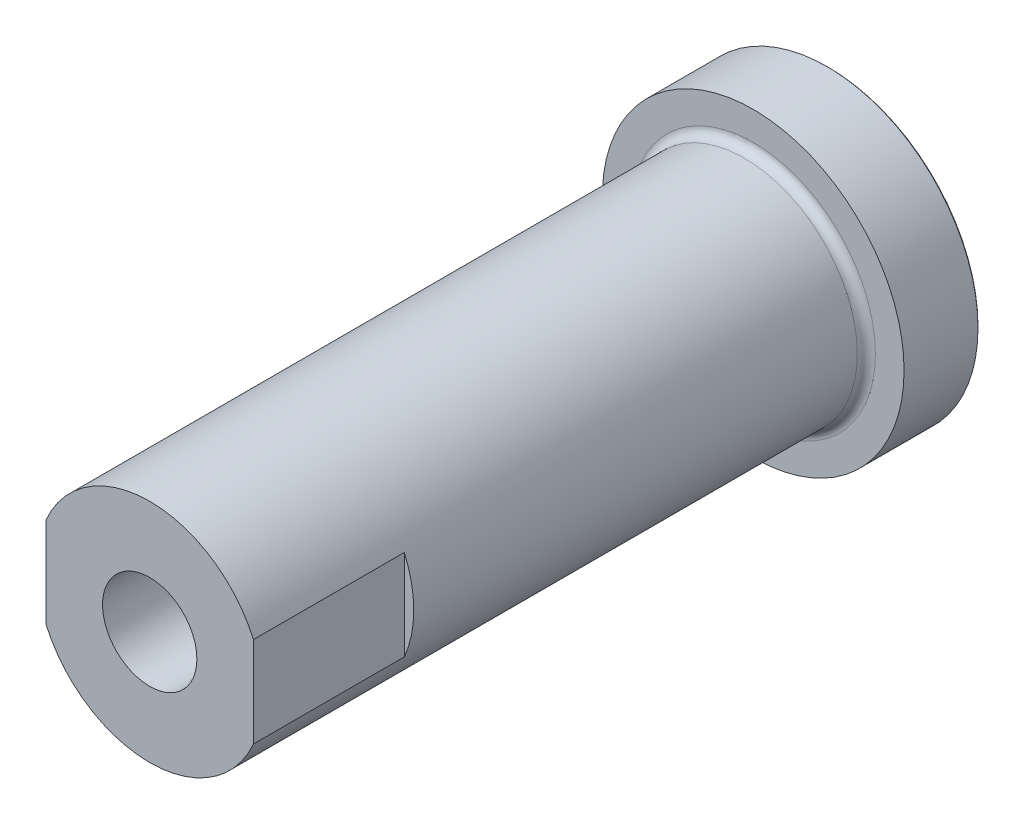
ISO-10303-21;
HEADER;
FILE_DESCRIPTION(('STEP AP214'),'2;1');
FILE_NAME('part.step','',(''),(''),'','','');
FILE_SCHEMA(('AUTOMOTIVE_DESIGN { 1 0 10303 214 1 1 1 1 }'));
ENDSEC;
DATA;
#1=APPLICATION_CONTEXT('core data for automotive mechanical design processes');
#2=APPLICATION_PROTOCOL_DEFINITION('international standard','automotive_design',2000,#1);
#3=PRODUCT_CONTEXT('',#1,'mechanical');
#4=PRODUCT('Part','Part','',(#3));
#5=PRODUCT_RELATED_PRODUCT_CATEGORY('part','',(#4));
#6=PRODUCT_DEFINITION_FORMATION('','',#4);
#7=PRODUCT_DEFINITION_CONTEXT('part definition',#1,'design');
#8=PRODUCT_DEFINITION('design','',#6,#7);
#9=PRODUCT_DEFINITION_SHAPE('','',#8);
#10=(LENGTH_UNIT() NAMED_UNIT(*) SI_UNIT(.MILLI.,.METRE.));
#11=(NAMED_UNIT(*) PLANE_ANGLE_UNIT() SI_UNIT($,.RADIAN.));
#12=(NAMED_UNIT(*) SI_UNIT($,.STERADIAN.) SOLID_ANGLE_UNIT());
#13=UNCERTAINTY_MEASURE_WITH_UNIT(LENGTH_MEASURE(1.E-05),#10,'distance_accuracy_value','');
#14=(GEOMETRIC_REPRESENTATION_CONTEXT(3) GLOBAL_UNCERTAINTY_ASSIGNED_CONTEXT((#13)) GLOBAL_UNIT_ASSIGNED_CONTEXT((#10,
#11,#12)) REPRESENTATION_CONTEXT('',''));
#15=CARTESIAN_POINT('',(0.,0.,0.));
#16=DIRECTION('',(0.,0.,1.));
#17=DIRECTION('',(1.,0.,0.));
#18=AXIS2_PLACEMENT_3D('',#15,#16,#17);
#19=CARTESIAN_POINT('',(0.,0.,-57.15));
#20=DIRECTION('',(0.,0.,-1.));
#21=DIRECTION('',(-1.,0.,0.));
#22=AXIS2_PLACEMENT_3D('',#19,#20,#21);
#23=PLANE('',#22);
#24=CARTESIAN_POINT('',(0.,0.,-57.15));
#25=DIRECTION('',(0.,0.,1.));
#26=DIRECTION('',(1.,0.,0.));
#27=AXIS2_PLACEMENT_3D('',#24,#25,#26);
#28=CIRCLE('',#27,12.573);
#29=CARTESIAN_POINT('',(12.573,0.,-57.15));
#30=VERTEX_POINT('',#29);
#31=EDGE_CURVE('E153',#30,#30,#28,.T.);
#32=ORIENTED_EDGE('',*,*,#31,.F.);
#33=EDGE_LOOP('',(#32));
#34=FACE_BOUND('',#33,.T.);
#35=ADVANCED_FACE('F51',(#34),#23,.T.);
#36=CARTESIAN_POINT('',(0.,0.,-22.1351088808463));
#37=DIRECTION('',(0.,0.,1.));
#38=DIRECTION('',(1.,0.,0.));
#39=AXIS2_PLACEMENT_3D('',#36,#37,#38);
#40=CONICAL_SURFACE('',#39,0.,1.0471975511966);
#41=CARTESIAN_POINT('',(0.,0.,-19.84375));
#42=DIRECTION('',(0.,0.,1.));
#43=DIRECTION('',(1.,0.,0.));
#44=AXIS2_PLACEMENT_3D('',#41,#42,#43);
#45=CIRCLE('',#44,3.96875);
#46=CARTESIAN_POINT('',(3.96875,0.,-19.84375));
#47=VERTEX_POINT('',#46);
#48=EDGE_CURVE('E133',#47,#47,#45,.T.);
#49=ORIENTED_EDGE('',*,*,#48,.T.);
#50=EDGE_LOOP('',(#49));
#51=FACE_BOUND('',#50,.T.);
#52=CARTESIAN_POINT('',(0.,0.,-22.1351088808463));
#53=VERTEX_POINT('',#52);
#54=VERTEX_LOOP('',#53);
#55=FACE_BOUND('',#54,.T.);
#56=ADVANCED_FACE('F192',(#51,#55),#40,.F.);
#57=CARTESIAN_POINT('',(0.,0.,6.51336325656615));
#58=DIRECTION('',(0.,0.,1.));
#59=DIRECTION('',(1.,0.,0.));
#60=AXIS2_PLACEMENT_3D('',#57,#58,#59);
#61=CYLINDRICAL_SURFACE('',#60,3.96875);
#62=CARTESIAN_POINT('',(0.,0.,0.));
#63=DIRECTION('',(0.,0.,1.));
#64=DIRECTION('',(1.,0.,0.));
#65=AXIS2_PLACEMENT_3D('',#62,#63,#64);
#66=CIRCLE('',#65,3.96875);
#67=CARTESIAN_POINT('',(3.96875,0.,0.));
#68=VERTEX_POINT('',#67);
#69=EDGE_CURVE('E124',#68,#68,#66,.T.);
#70=ORIENTED_EDGE('',*,*,#69,.T.);
#71=EDGE_LOOP('',(#70));
#72=FACE_BOUND('',#71,.T.);
#73=ORIENTED_EDGE('',*,*,#48,.F.);
#74=EDGE_LOOP('',(#73));
#75=FACE_BOUND('',#74,.T.);
#76=ADVANCED_FACE('F197',(#72,#75),#61,.F.);
#77=CARTESIAN_POINT('',(9.52500000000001,0.,0.));
#78=DIRECTION('',(0.,0.,1.));
#79=DIRECTION('',(1.,0.,0.));
#80=AXIS2_PLACEMENT_3D('',#77,#78,#79);
#81=PLANE('',#80);
#82=DIRECTION('',(0.,1.,0.));
#83=VECTOR('',#82,1.);
#84=CARTESIAN_POINT('',(-8.73124999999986,-19.05,-2.74086309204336E-13));
#85=LINE('',#84,#83);
#86=CARTESIAN_POINT('',(-8.73124999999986,-3.80669127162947,0.));
#87=VERTEX_POINT('',#86);
#88=CARTESIAN_POINT('',(-8.73124999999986,3.80669127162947,0.));
#89=VERTEX_POINT('',#88);
#90=EDGE_CURVE('E95',#87,#89,#85,.T.);
#91=ORIENTED_EDGE('',*,*,#90,.F.);
#92=CARTESIAN_POINT('',(0.,0.,0.));
#93=DIRECTION('',(0.,0.,1.));
#94=DIRECTION('',(1.,0.,0.));
#95=AXIS2_PLACEMENT_3D('',#92,#93,#94);
#96=CIRCLE('',#95,9.525);
#97=CARTESIAN_POINT('',(8.73124999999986,-3.80669127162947,0.));
#98=VERTEX_POINT('',#97);
#99=EDGE_CURVE('E108',#87,#98,#96,.T.);
#100=ORIENTED_EDGE('',*,*,#99,.T.);
#101=DIRECTION('',(0.,1.,0.));
#102=VECTOR('',#101,1.);
#103=CARTESIAN_POINT('',(8.73124999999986,-19.05,-2.74086309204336E-13));
#104=LINE('',#103,#102);
#105=CARTESIAN_POINT('',(8.73124999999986,3.80669127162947,0.));
#106=VERTEX_POINT('',#105);
#107=EDGE_CURVE('E151',#98,#106,#104,.T.);
#108=ORIENTED_EDGE('',*,*,#107,.T.);
#109=EDGE_CURVE('E111',#106,#89,#96,.T.);
#110=ORIENTED_EDGE('',*,*,#109,.T.);
#111=EDGE_LOOP('',(#91,#100,#108,#110));
#112=FACE_BOUND('',#111,.T.);
#113=ORIENTED_EDGE('',*,*,#69,.F.);
#114=EDGE_LOOP('',(#113));
#115=FACE_BOUND('',#114,.T.);
#116=ADVANCED_FACE('F105',(#112,#115),#81,.T.);
#117=CARTESIAN_POINT('',(0.,0.,6.51336325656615));
#118=DIRECTION('',(0.,0.,1.));
#119=DIRECTION('',(1.,0.,0.));
#120=AXIS2_PLACEMENT_3D('',#117,#118,#119);
#121=CYLINDRICAL_SURFACE('',#120,9.525);
#122=DIRECTION('',(0.,0.,1.));
#123=VECTOR('',#122,1.);
#124=CARTESIAN_POINT('',(-8.73124999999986,3.80669127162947,6.51336325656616));
#125=LINE('',#124,#123);
#126=CARTESIAN_POINT('',(-8.73124999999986,3.80669127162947,-12.7));
#127=VERTEX_POINT('',#126);
#128=EDGE_CURVE('E11',#89,#127,#125,.F.);
#129=ORIENTED_EDGE('',*,*,#128,.F.);
#130=ORIENTED_EDGE('',*,*,#109,.F.);
#131=DIRECTION('',(0.,0.,1.));
#132=VECTOR('',#131,1.);
#133=CARTESIAN_POINT('',(8.73124999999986,3.80669127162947,6.51336325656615));
#134=LINE('',#133,#132);
#135=CARTESIAN_POINT('',(8.73124999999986,3.80669127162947,-12.7));
#136=VERTEX_POINT('',#135);
#137=EDGE_CURVE('E140',#136,#106,#134,.T.);
#138=ORIENTED_EDGE('',*,*,#137,.F.);
#139=CARTESIAN_POINT('',(0.,0.,-12.7));
#140=DIRECTION('',(0.,0.,-1.));
#141=DIRECTION('',(-1.,0.,0.));
#142=AXIS2_PLACEMENT_3D('',#139,#140,#141);
#143=CIRCLE('',#142,9.525);
#144=CARTESIAN_POINT('',(8.73124999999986,-3.80669127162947,-12.7));
#145=VERTEX_POINT('',#144);
#146=EDGE_CURVE('E137',#145,#136,#143,.F.);
#147=ORIENTED_EDGE('',*,*,#146,.F.);
#148=DIRECTION('',(0.,0.,1.));
#149=VECTOR('',#148,1.);
#150=CARTESIAN_POINT('',(8.73124999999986,-3.80669127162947,6.51336325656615));
#151=LINE('',#150,#149);
#152=EDGE_CURVE('E101',#98,#145,#151,.F.);
#153=ORIENTED_EDGE('',*,*,#152,.F.);
#154=ORIENTED_EDGE('',*,*,#99,.F.);
#155=DIRECTION('',(0.,0.,1.));
#156=VECTOR('',#155,1.);
#157=CARTESIAN_POINT('',(-8.73124999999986,-3.80669127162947,6.51336325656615));
#158=LINE('',#157,#156);
#159=CARTESIAN_POINT('',(-8.73124999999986,-3.80669127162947,-12.7));
#160=VERTEX_POINT('',#159);
#161=EDGE_CURVE('E92',#160,#87,#158,.T.);
#162=ORIENTED_EDGE('',*,*,#161,.F.);
#163=CARTESIAN_POINT('',(0.,0.,-12.7));
#164=DIRECTION('',(0.,0.,-1.));
#165=DIRECTION('',(-1.,0.,0.));
#166=AXIS2_PLACEMENT_3D('',#163,#164,#165);
#167=CIRCLE('',#166,9.525);
#168=EDGE_CURVE('E59',#127,#160,#167,.F.);
#169=ORIENTED_EDGE('',*,*,#168,.F.);
#170=EDGE_LOOP('',(#129,#130,#138,#147,#153,#154,#162,#169));
#171=FACE_BOUND('',#170,.T.);
#172=CARTESIAN_POINT('',(0.,0.,-50.038));
#173=DIRECTION('',(0.,0.,1.));
#174=DIRECTION('',(1.,0.,0.));
#175=AXIS2_PLACEMENT_3D('',#172,#173,#174);
#176=CIRCLE('',#175,9.525);
#177=CARTESIAN_POINT('',(9.525,0.,-50.038));
#178=VERTEX_POINT('',#177);
#179=EDGE_CURVE('E119',#178,#178,#176,.T.);
#180=ORIENTED_EDGE('',*,*,#179,.T.);
#181=EDGE_LOOP('',(#180));
#182=FACE_BOUND('',#181,.T.);
#183=ADVANCED_FACE('F115',(#171,#182),#121,.T.);
#184=CARTESIAN_POINT('',(0.,0.,-50.038));
#185=DIRECTION('',(0.,0.,1.));
#186=DIRECTION('',(1.,0.,0.));
#187=AXIS2_PLACEMENT_3D('',#184,#185,#186);
#188=TOROIDAL_SURFACE('',#187,10.287,0.762000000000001);
#189=CARTESIAN_POINT('',(0.,0.,-50.8));
#190=DIRECTION('',(0.,0.,1.));
#191=DIRECTION('',(1.,0.,0.));
#192=AXIS2_PLACEMENT_3D('',#189,#190,#191);
#193=CIRCLE('',#192,10.287);
#194=CARTESIAN_POINT('',(10.287,0.,-50.8));
#195=VERTEX_POINT('',#194);
#196=EDGE_CURVE('E126',#195,#195,#193,.T.);
#197=ORIENTED_EDGE('',*,*,#196,.T.);
#198=EDGE_LOOP('',(#197));
#199=FACE_BOUND('',#198,.T.);
#200=ORIENTED_EDGE('',*,*,#179,.F.);
#201=EDGE_LOOP('',(#200));
#202=FACE_BOUND('',#201,.T.);
#203=ADVANCED_FACE('F175',(#199,#202),#188,.F.);
#204=CARTESIAN_POINT('',(12.7000000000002,0.,-50.8));
#205=DIRECTION('',(0.,0.,1.));
#206=DIRECTION('',(1.,0.,0.));
#207=AXIS2_PLACEMENT_3D('',#204,#205,#206);
#208=PLANE('',#207);
#209=CARTESIAN_POINT('',(0.,0.,-50.8));
#210=DIRECTION('',(0.,0.,1.));
#211=DIRECTION('',(1.,0.,0.));
#212=AXIS2_PLACEMENT_3D('',#209,#210,#211);
#213=CIRCLE('',#212,12.7);
#214=CARTESIAN_POINT('',(12.7,0.,-50.8));
#215=VERTEX_POINT('',#214);
#216=EDGE_CURVE('E167',#215,#215,#213,.T.);
#217=ORIENTED_EDGE('',*,*,#216,.T.);
#218=EDGE_LOOP('',(#217));
#219=FACE_BOUND('',#218,.T.);
#220=ORIENTED_EDGE('',*,*,#196,.F.);
#221=EDGE_LOOP('',(#220));
#222=FACE_BOUND('',#221,.T.);
#223=ADVANCED_FACE('F178',(#219,#222),#208,.T.);
#224=CARTESIAN_POINT('',(0.,0.,6.51336325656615));
#225=DIRECTION('',(0.,0.,1.));
#226=DIRECTION('',(1.,0.,0.));
#227=AXIS2_PLACEMENT_3D('',#224,#225,#226);
#228=CYLINDRICAL_SURFACE('',#227,12.7);
#229=CARTESIAN_POINT('',(0.,0.,-57.023));
#230=DIRECTION('',(0.,0.,1.));
#231=DIRECTION('',(1.,0.,0.));
#232=AXIS2_PLACEMENT_3D('',#229,#230,#231);
#233=CIRCLE('',#232,12.7);
#234=CARTESIAN_POINT('',(12.7,0.,-57.023));
#235=VERTEX_POINT('',#234);
#236=EDGE_CURVE('E159',#235,#235,#233,.T.);
#237=ORIENTED_EDGE('',*,*,#236,.T.);
#238=EDGE_LOOP('',(#237));
#239=FACE_BOUND('',#238,.T.);
#240=ORIENTED_EDGE('',*,*,#216,.F.);
#241=EDGE_LOOP('',(#240));
#242=FACE_BOUND('',#241,.T.);
#243=ADVANCED_FACE('F180',(#239,#242),#228,.T.);
#244=CARTESIAN_POINT('',(0.,0.,-57.023));
#245=DIRECTION('',(0.,0.,1.));
#246=DIRECTION('',(1.,0.,0.));
#247=AXIS2_PLACEMENT_3D('',#244,#245,#246);
#248=CONICAL_SURFACE('',#247,12.7,0.785398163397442);
#249=ORIENTED_EDGE('',*,*,#31,.T.);
#250=EDGE_LOOP('',(#249));
#251=FACE_BOUND('',#250,.T.);
#252=ORIENTED_EDGE('',*,*,#236,.F.);
#253=EDGE_LOOP('',(#252));
#254=FACE_BOUND('',#253,.T.);
#255=ADVANCED_FACE('F187',(#251,#254),#248,.T.);
#256=CARTESIAN_POINT('',(8.73124999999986,-19.05,-2.74086309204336E-13));
#257=DIRECTION('',(-1.,0.,0.));
#258=DIRECTION('',(0.,0.,1.));
#259=AXIS2_PLACEMENT_3D('',#256,#257,#258);
#260=PLANE('',#259);
#261=ORIENTED_EDGE('',*,*,#152,.T.);
#262=DIRECTION('',(0.,1.,0.));
#263=VECTOR('',#262,1.);
#264=CARTESIAN_POINT('',(8.73124999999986,-19.05,-12.7));
#265=LINE('',#264,#263);
#266=EDGE_CURVE('E72',#145,#136,#265,.T.);
#267=ORIENTED_EDGE('',*,*,#266,.T.);
#268=ORIENTED_EDGE('',*,*,#137,.T.);
#269=ORIENTED_EDGE('',*,*,#107,.F.);
#270=EDGE_LOOP('',(#261,#267,#268,#269));
#271=FACE_BOUND('',#270,.T.);
#272=ADVANCED_FACE('F150',(#271),#260,.F.);
#273=CARTESIAN_POINT('',(12.7000000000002,-19.05,-12.7));
#274=DIRECTION('',(0.,0.,-1.));
#275=DIRECTION('',(-1.,0.,0.));
#276=AXIS2_PLACEMENT_3D('',#273,#274,#275);
#277=PLANE('',#276);
#278=ORIENTED_EDGE('',*,*,#146,.T.);
#279=ORIENTED_EDGE('',*,*,#266,.F.);
#280=EDGE_LOOP('',(#278,#279));
#281=FACE_BOUND('',#280,.T.);
#282=ADVANCED_FACE('F210',(#281),#277,.F.);
#283=CARTESIAN_POINT('',(-12.7000000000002,-19.05,-12.7));
#284=DIRECTION('',(0.,0.,-1.));
#285=DIRECTION('',(-1.,0.,0.));
#286=AXIS2_PLACEMENT_3D('',#283,#284,#285);
#287=PLANE('',#286);
#288=ORIENTED_EDGE('',*,*,#168,.T.);
#289=DIRECTION('',(0.,1.,0.));
#290=VECTOR('',#289,1.);
#291=CARTESIAN_POINT('',(-8.73124999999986,-19.05,-12.7));
#292=LINE('',#291,#290);
#293=EDGE_CURVE('E65',#160,#127,#292,.T.);
#294=ORIENTED_EDGE('',*,*,#293,.T.);
#295=EDGE_LOOP('',(#288,#294));
#296=FACE_BOUND('',#295,.T.);
#297=ADVANCED_FACE('F147',(#296),#287,.F.);
#298=CARTESIAN_POINT('',(-8.73124999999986,-19.05,-2.74086309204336E-13));
#299=DIRECTION('',(1.,0.,0.));
#300=DIRECTION('',(0.,0.,-1.));
#301=AXIS2_PLACEMENT_3D('',#298,#299,#300);
#302=PLANE('',#301);
#303=ORIENTED_EDGE('',*,*,#128,.T.);
#304=ORIENTED_EDGE('',*,*,#293,.F.);
#305=ORIENTED_EDGE('',*,*,#161,.T.);
#306=ORIENTED_EDGE('',*,*,#90,.T.);
#307=EDGE_LOOP('',(#303,#304,#305,#306));
#308=FACE_BOUND('',#307,.T.);
#309=ADVANCED_FACE('F94',(#308),#302,.F.);
#310=CLOSED_SHELL('',(#35,#56,#76,#116,#183,#203,#223,#243,#255,#272,#282,#297,#309));
#311=MANIFOLD_SOLID_BREP('B2',#310);
#312=ADVANCED_BREP_SHAPE_REPRESENTATION('',(#18,#311),#14);
#313=SHAPE_DEFINITION_REPRESENTATION(#9,#312);
ENDSEC;
END-ISO-10303-21;
